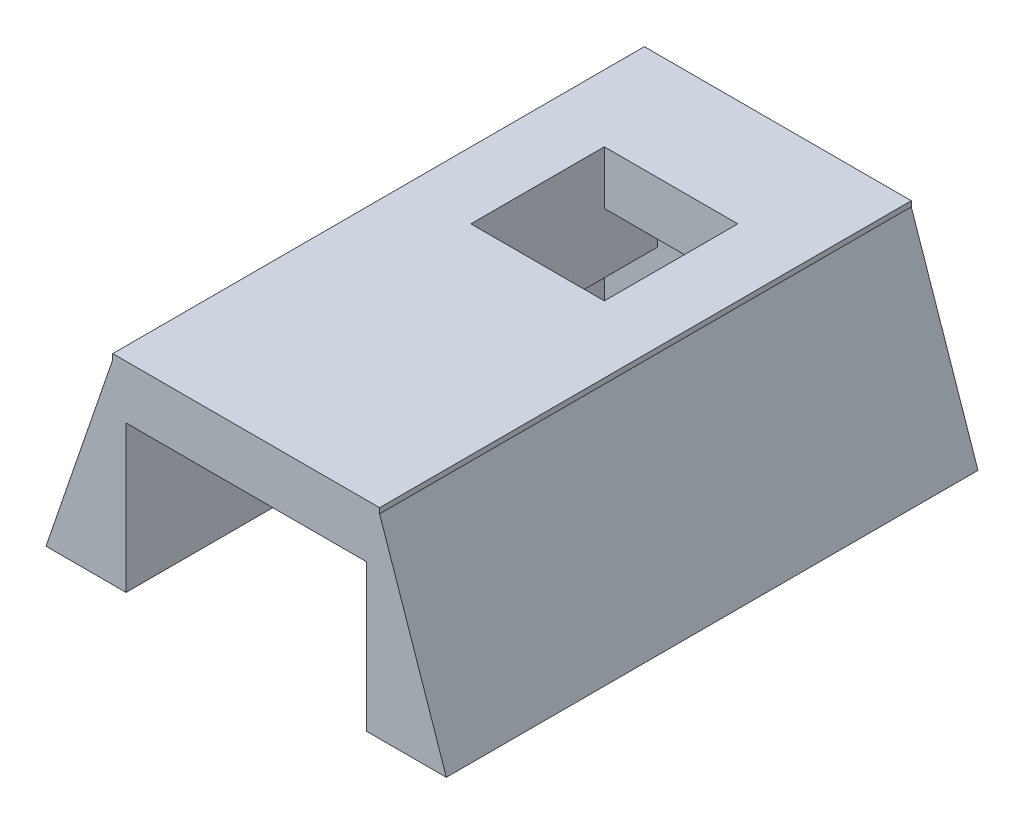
from build123d import *

# Parameters (mm, degrees)
BOSS_EXTRUDE1_DEPTH = 19.92051609
CUT_EXTRUDE3_DEPTH  = 5.5
SKETCH5_W           = 9
SKETCH5_H           = 3.25
CUT_EXTRUDE5_DEPTH  = 23.568273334
SKETCH6_W           = 12
SKETCH6_H           = 2
BOSS_EXTRUDE2_DEPTH = 3.25
SKETCH7_W           = 7.058859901
SKETCH7_H           = 2
BOSS_EXTRUDE3_DEPTH = 6
SKETCH4_W           = 5
SKETCH4_H           = 5
CUT_EXTRUDE4_DEPTH  = 23.568273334


with BuildPart() as part:
    # Sketch2 → Boss-Extrude1 (new body)
    with BuildSketch(Plane.XY):
        Polygon((-7.5, 0), (-5, 7.3), (-5, 7.5), (5, 7.5), (5, 7.3), (7.5, 0), align=None)
    extrude(amount=BOSS_EXTRUDE1_DEPTH)

    # Sketch3 → Cut-Extrude3 (cut)
    with BuildSketch(Plane(origin=(0, 0, 0), x_dir=(1, 0, 0), z_dir=(0, 1, 0))):
        Polygon((-4.5, -19.92051609), (4.5, -19.92051609), (4.5, -11), (2.5, -11), (2.5, 0), (-2.5, 0), (-2.5, -11), (-4.5, -11), align=None)
    extrude(amount=CUT_EXTRUDE3_DEPTH, mode=Mode.SUBTRACT)

    # Sketch5 → Cut-Extrude5 (cut, through all)
    with BuildSketch(Plane(origin=(0, 0, 0), x_dir=(-1, 0, 0), z_dir=(0, 0, -1))):
        with Locations((0, 1.625)):
            Rectangle(SKETCH5_W, SKETCH5_H)
    extrude(amount=-CUT_EXTRUDE5_DEPTH, mode=Mode.SUBTRACT)

    # Sketch6 → Boss-Extrude2 (add)
    with BuildSketch(Plane.XZ.offset(-3.25)):
        with Locations((0, 1)):
            Rectangle(SKETCH6_W, SKETCH6_H)
    extrude(amount=BOSS_EXTRUDE2_DEPTH)

    # Sketch7 → Boss-Extrude3 (add)
    with BuildSketch(Plane.XZ):
        with Locations((0.029429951, 1)):
            Rectangle(SKETCH7_W, SKETCH7_H)
    extrude(amount=-BOSS_EXTRUDE3_DEPTH)

    # Sketch4 → Cut-Extrude4 (cut, through all)
    with BuildSketch(Plane(origin=(0, 7.5, 0), x_dir=(1, 0, 0), z_dir=(0, 1, 0))):
        with Locations((0, -6.5)):
            Rectangle(SKETCH4_W, SKETCH4_H)
    extrude(amount=-CUT_EXTRUDE4_DEPTH, mode=Mode.SUBTRACT)


solid = part.part
